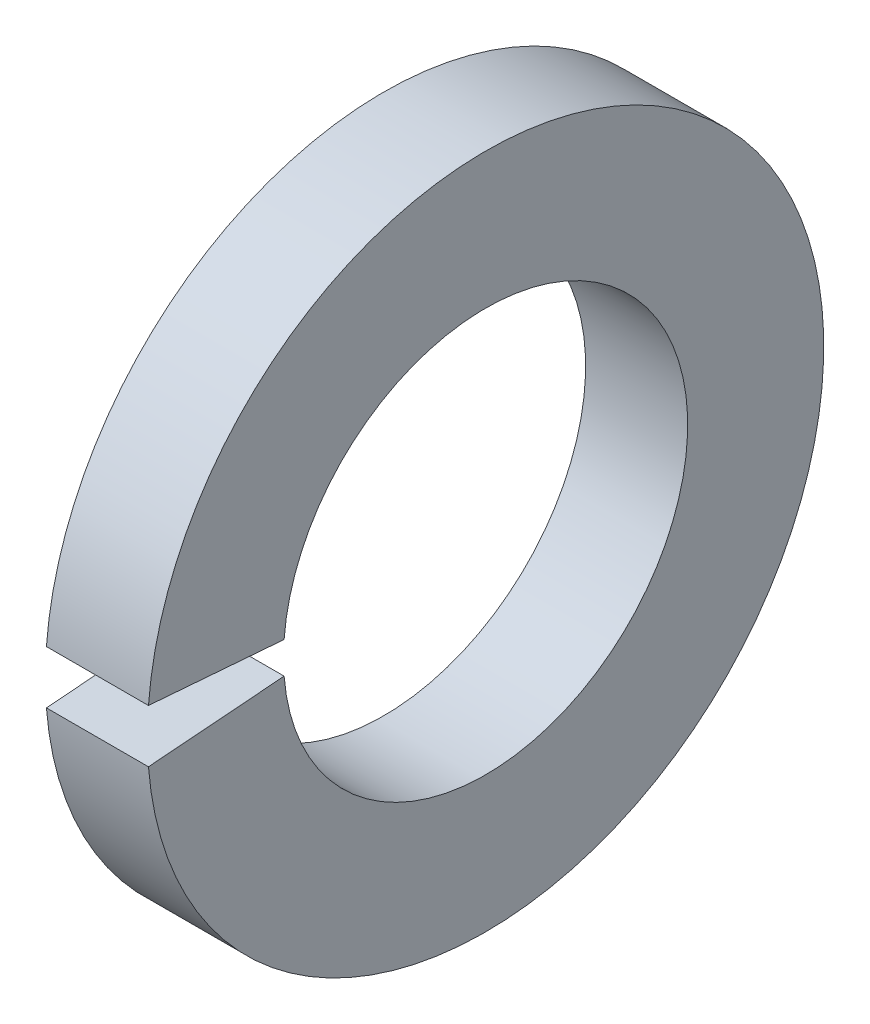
from build123d import *

# Parameters (mm, degrees)
SKETCH1_W = 5.1
SKETCH1_H = 6.8
GAP_DEPTH = 25.438289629


with BuildPart() as part:
    # Sketch1 → Base-Revolve (revolve)
    with BuildSketch(Plane.XY, mode=Mode.PRIVATE) as base_revolve_sk:
        with Locations((-2.55, 13.5)):
            Rectangle(SKETCH1_W, SKETCH1_H)
    revolve(base_revolve_sk.sketch.rotate(Axis((-34.925, 0, 0), (1, 0, 0)), 90), axis=Axis((-34.925, 0, 0), (1, 0, 0)))

    # Sketch2 → Gap (cut, through all)
    with BuildSketch(Plane(origin=(0, 0, 0), x_dir=(0, -1, 0), z_dir=(-1, 0, 0))):
        with BuildLine():
            Line((0, 0), (1.352477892, 17.184860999))
            ThreePointArc((1.352477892, 17.184860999), (0, 17.238), (-1.352477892, 17.184860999))
            Line((-1.352477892, 17.184860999), (0, 0))
        make_face()
    extrude(amount=GAP_DEPTH, mode=Mode.SUBTRACT)


solid = part.part
